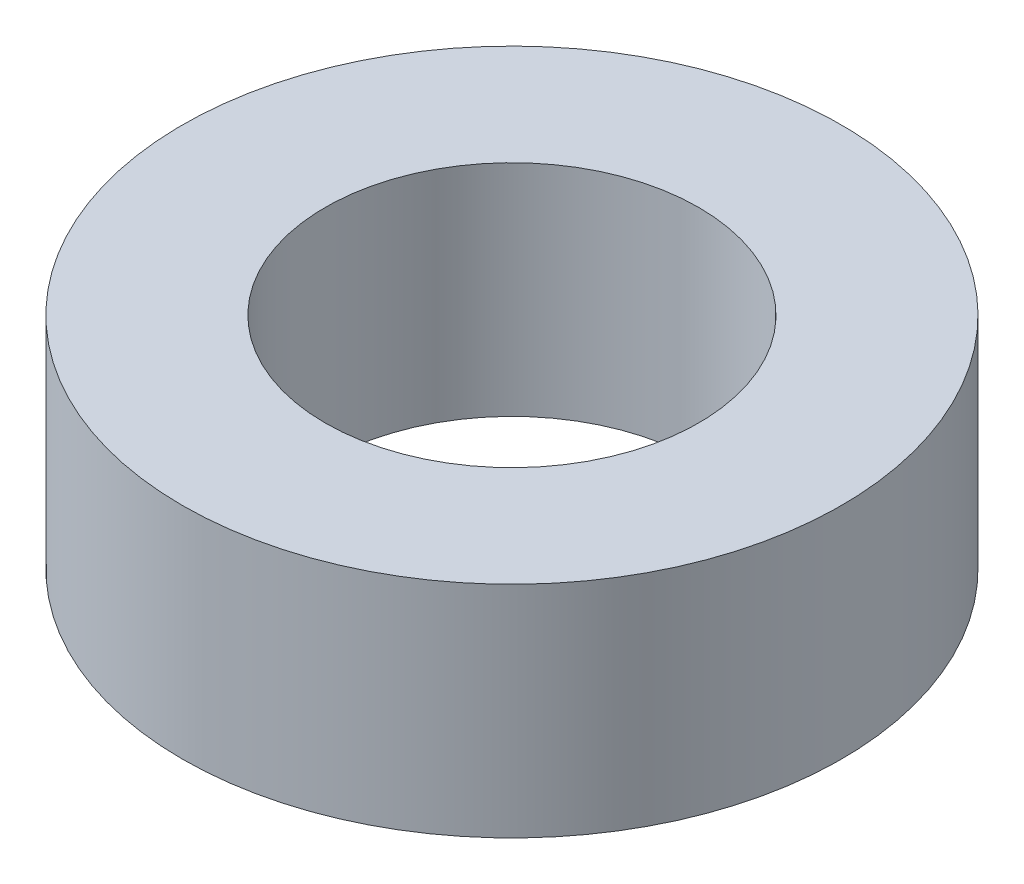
ISO-10303-21;
HEADER;
FILE_DESCRIPTION(('STEP AP214'),'2;1');
FILE_NAME('part.step','',(''),(''),'','','');
FILE_SCHEMA(('AUTOMOTIVE_DESIGN { 1 0 10303 214 1 1 1 1 }'));
ENDSEC;
DATA;
#1=APPLICATION_CONTEXT('core data for automotive mechanical design processes');
#2=APPLICATION_PROTOCOL_DEFINITION('international standard','automotive_design',2000,#1);
#3=PRODUCT_CONTEXT('',#1,'mechanical');
#4=PRODUCT('Part','Part','',(#3));
#5=PRODUCT_RELATED_PRODUCT_CATEGORY('part','',(#4));
#6=PRODUCT_DEFINITION_FORMATION('','',#4);
#7=PRODUCT_DEFINITION_CONTEXT('part definition',#1,'design');
#8=PRODUCT_DEFINITION('design','',#6,#7);
#9=PRODUCT_DEFINITION_SHAPE('','',#8);
#10=(LENGTH_UNIT() NAMED_UNIT(*) SI_UNIT(.MILLI.,.METRE.));
#11=(NAMED_UNIT(*) PLANE_ANGLE_UNIT() SI_UNIT($,.RADIAN.));
#12=(NAMED_UNIT(*) SI_UNIT($,.STERADIAN.) SOLID_ANGLE_UNIT());
#13=UNCERTAINTY_MEASURE_WITH_UNIT(LENGTH_MEASURE(1.E-05),#10,'distance_accuracy_value','');
#14=(GEOMETRIC_REPRESENTATION_CONTEXT(3) GLOBAL_UNCERTAINTY_ASSIGNED_CONTEXT((#13)) GLOBAL_UNIT_ASSIGNED_CONTEXT((#10,
#11,#12)) REPRESENTATION_CONTEXT('',''));
#15=CARTESIAN_POINT('',(0.,0.,0.));
#16=DIRECTION('',(0.,0.,1.));
#17=DIRECTION('',(1.,0.,0.));
#18=AXIS2_PLACEMENT_3D('',#15,#16,#17);
#19=CARTESIAN_POINT('',(0.,0.,0.));
#20=DIRECTION('',(0.,1.,0.));
#21=DIRECTION('',(1.,0.,0.));
#22=AXIS2_PLACEMENT_3D('',#19,#20,#21);
#23=PLANE('',#22);
#24=CARTESIAN_POINT('',(0.,0.,0.));
#25=DIRECTION('',(0.,1.,0.));
#26=DIRECTION('',(0.,0.,1.));
#27=AXIS2_PLACEMENT_3D('',#24,#25,#26);
#28=CIRCLE('',#27,1.7);
#29=CARTESIAN_POINT('',(0.,0.,1.7));
#30=VERTEX_POINT('',#29);
#31=EDGE_CURVE('E31',#30,#30,#28,.T.);
#32=ORIENTED_EDGE('',*,*,#31,.T.);
#33=EDGE_LOOP('',(#32));
#34=FACE_BOUND('',#33,.T.);
#35=CARTESIAN_POINT('',(0.,0.,0.));
#36=DIRECTION('',(0.,1.,0.));
#37=DIRECTION('',(0.,0.,1.));
#38=AXIS2_PLACEMENT_3D('',#35,#36,#37);
#39=CIRCLE('',#38,3.);
#40=CARTESIAN_POINT('',(0.,0.,3.));
#41=VERTEX_POINT('',#40);
#42=EDGE_CURVE('E10',#41,#41,#39,.T.);
#43=ORIENTED_EDGE('',*,*,#42,.F.);
#44=EDGE_LOOP('',(#43));
#45=FACE_BOUND('',#44,.T.);
#46=ADVANCED_FACE('F15',(#34,#45),#23,.F.);
#47=CARTESIAN_POINT('',(0.,2.,0.));
#48=DIRECTION('',(0.,1.,0.));
#49=DIRECTION('',(1.,0.,0.));
#50=AXIS2_PLACEMENT_3D('',#47,#48,#49);
#51=PLANE('',#50);
#52=CARTESIAN_POINT('',(0.,2.,0.));
#53=DIRECTION('',(0.,1.,0.));
#54=DIRECTION('',(0.,0.,1.));
#55=AXIS2_PLACEMENT_3D('',#52,#53,#54);
#56=CIRCLE('',#55,1.7);
#57=CARTESIAN_POINT('',(0.,2.,1.7));
#58=VERTEX_POINT('',#57);
#59=EDGE_CURVE('E38',#58,#58,#56,.T.);
#60=ORIENTED_EDGE('',*,*,#59,.F.);
#61=EDGE_LOOP('',(#60));
#62=FACE_BOUND('',#61,.T.);
#63=CARTESIAN_POINT('',(0.,2.,0.));
#64=DIRECTION('',(0.,1.,0.));
#65=DIRECTION('',(0.,0.,1.));
#66=AXIS2_PLACEMENT_3D('',#63,#64,#65);
#67=CIRCLE('',#66,3.);
#68=CARTESIAN_POINT('',(0.,2.,3.));
#69=VERTEX_POINT('',#68);
#70=EDGE_CURVE('E22',#69,#69,#67,.T.);
#71=ORIENTED_EDGE('',*,*,#70,.T.);
#72=EDGE_LOOP('',(#71));
#73=FACE_BOUND('',#72,.T.);
#74=ADVANCED_FACE('F49',(#62,#73),#51,.T.);
#75=CARTESIAN_POINT('',(0.,2.,0.));
#76=DIRECTION('',(0.,-1.,0.));
#77=DIRECTION('',(0.,0.,-1.));
#78=AXIS2_PLACEMENT_3D('',#75,#76,#77);
#79=CYLINDRICAL_SURFACE('',#78,3.);
#80=ORIENTED_EDGE('',*,*,#42,.T.);
#81=EDGE_LOOP('',(#80));
#82=FACE_BOUND('',#81,.T.);
#83=ORIENTED_EDGE('',*,*,#70,.F.);
#84=EDGE_LOOP('',(#83));
#85=FACE_BOUND('',#84,.T.);
#86=ADVANCED_FACE('F51',(#82,#85),#79,.T.);
#87=CARTESIAN_POINT('',(0.,2.,0.));
#88=DIRECTION('',(0.,-1.,0.));
#89=DIRECTION('',(0.,0.,-1.));
#90=AXIS2_PLACEMENT_3D('',#87,#88,#89);
#91=CYLINDRICAL_SURFACE('',#90,1.7);
#92=ORIENTED_EDGE('',*,*,#31,.F.);
#93=EDGE_LOOP('',(#92));
#94=FACE_BOUND('',#93,.T.);
#95=ORIENTED_EDGE('',*,*,#59,.T.);
#96=EDGE_LOOP('',(#95));
#97=FACE_BOUND('',#96,.T.);
#98=ADVANCED_FACE('F47',(#94,#97),#91,.F.);
#99=CLOSED_SHELL('',(#46,#74,#86,#98));
#100=MANIFOLD_SOLID_BREP('B1',#99);
#101=ADVANCED_BREP_SHAPE_REPRESENTATION('',(#18,#100),#14);
#102=SHAPE_DEFINITION_REPRESENTATION(#9,#101);
ENDSEC;
END-ISO-10303-21;
